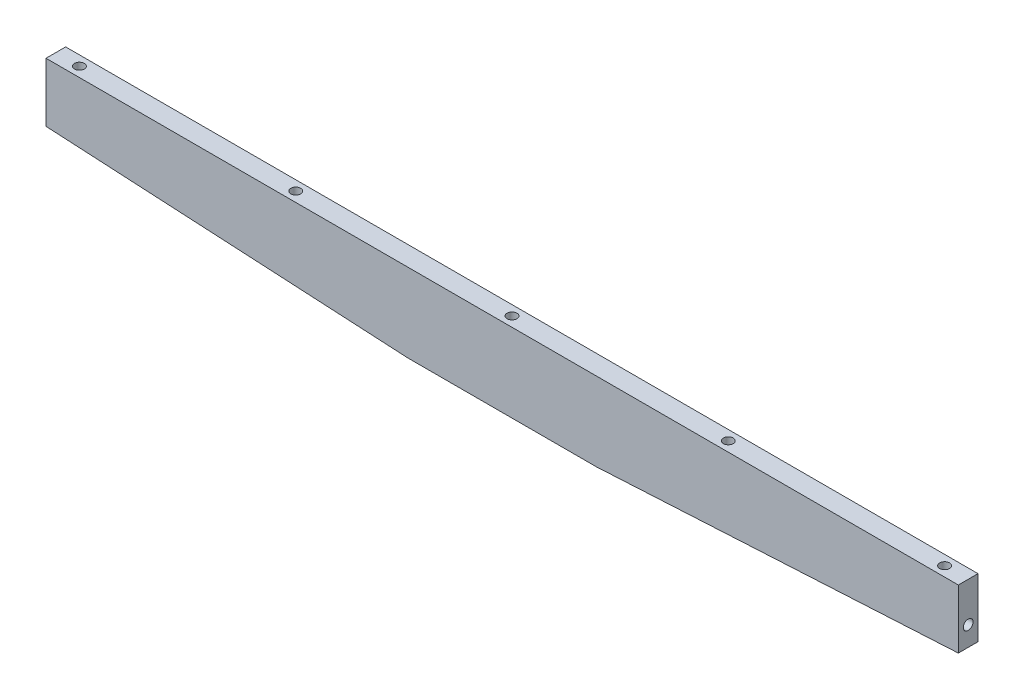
from build123d import *

# Parameters (mm, degrees)
BOSS_EXTRUDE1_DEPTH = 6.35
SKETCH2_R           = 3.175
CUT_EXTRUDE1_DEPTH  = 19.05
SKETCH3_R           = 3.175
CUT_EXTRUDE2_DEPTH  = 19.05
SKETCH4_R           = 3.175
CUT_EXTRUDE3_DEPTH  = 19.812


with BuildPart() as part:
    # Sketch1 → Boss-Extrude1 (new, symmetric)
    with BuildSketch(Plane.XY):
        Polygon((294.64, 0), (-294.64, 0), (-294.64, -38.1), (-60.96, -50.8), (60.96, -50.8), (294.64, -38.1), align=None)
    extrude(amount=BOSS_EXTRUDE1_DEPTH, both=True)

    # Sketch2 → Cut-Extrude1 (cut)
    with BuildSketch(Plane(origin=(0, 0, 0), x_dir=(1, 0, 0), z_dir=(0, 1, 0))):
        with Locations(Location((-279.4, 0, 0), (0, 0, 270))):
            Circle(SKETCH2_R)
        with Locations(Location((-139.7, 0, 0), (0, 0, 270))):
            Circle(SKETCH2_R)
        with Locations(Location((0, 0, 0), (0, 0, 270))):
            Circle(SKETCH2_R)
        with Locations(Location((139.7, 0, 0), (0, 0, 270))):
            Circle(SKETCH2_R)
        with Locations(Location((279.4, 0, 0), (0, 0, 270))):
            Circle(SKETCH2_R)
    extrude(amount=-CUT_EXTRUDE1_DEPTH, mode=Mode.SUBTRACT)

    # Sketch3 → Cut-Extrude2 (cut)
    with BuildSketch(Plane.ZY.offset(294.64)):
        with Locations((0, -25.4)):
            Circle(SKETCH3_R)
    cut_extrude2 = extrude(amount=-CUT_EXTRUDE2_DEPTH, mode=Mode.SUBTRACT)

    # Sketch4 → Cut-Extrude3 (cut)
    with BuildSketch(Plane(origin=(0, -42.672, 0), x_dir=(1, 0, 0), z_dir=(0, 1, 0))):
        with Locations(Location((250.19, 0, 0), (0, 0, 180))):
            Circle(SKETCH4_R)
    cut_extrude3 = extrude(amount=CUT_EXTRUDE3_DEPTH, mode=Mode.SUBTRACT)

    # Mirror1: Cut-Extrude2, Cut-Extrude3 across plane
    add(cut_extrude2.mirror(Plane(origin=(0, 0, 0), x_dir=(0, 0, 1), z_dir=(1, 0, 0))), mode=Mode.SUBTRACT)
    add(cut_extrude3.mirror(Plane(origin=(0, 0, 0), x_dir=(0, 0, 1), z_dir=(1, 0, 0))), mode=Mode.SUBTRACT)


solid = part.part
